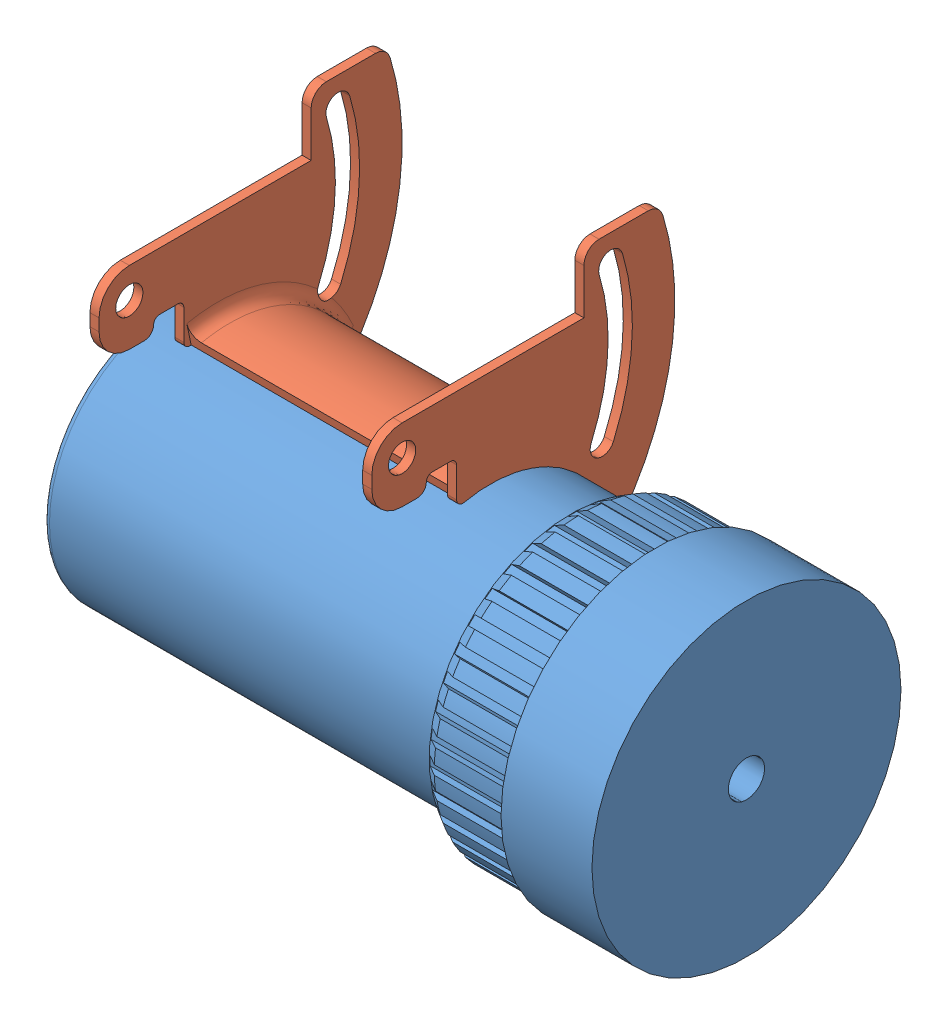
SolidWorks assembly Moteur.SLDASM, configuration Défaut (file format 9000). Lengths in mm.
Overall size (190 145.04 111.86).
2 component instances, 2 part files, 3 mates.
Components (placement in the parent):
- Moteur-1: Moteur.SLDPRT [Défaut] at (-170.719 25.3994 0) size (190 102 102)
- Pate de fixation moteur-1: Pate de fixation moteur.SLDPRT [Défaut] at (-158.219 119.4395 -55.7124) x (0 0 -1) z (1 0 0) size (100 80 93)
Mates (geometry in assembly coordinates):
- Coaxiale1: concentric aligned: cylinder of Moteur-1 through (-170.719 25.3994 0) axis (-1 0 0) radius 42; cylinder of Pate de fixation moteur-1 through (-155.219 25.3994 0) axis (-1 0 0) radius 42
- Parallèle1: parallel aligned: plane of Moteur-1; plane of Pate de fixation moteur-1 through (-65.219 78.4395 11.1404) normal (0 0 1)
- Distance1: distance = 12.5 mm aligned: plane of Moteur-1 through (-170.719 31.3994 0) normal (-1 0 0); plane of Pate de fixation moteur-1 through (-158.219 89.4395 29.1404) normal (-1 0 0)
